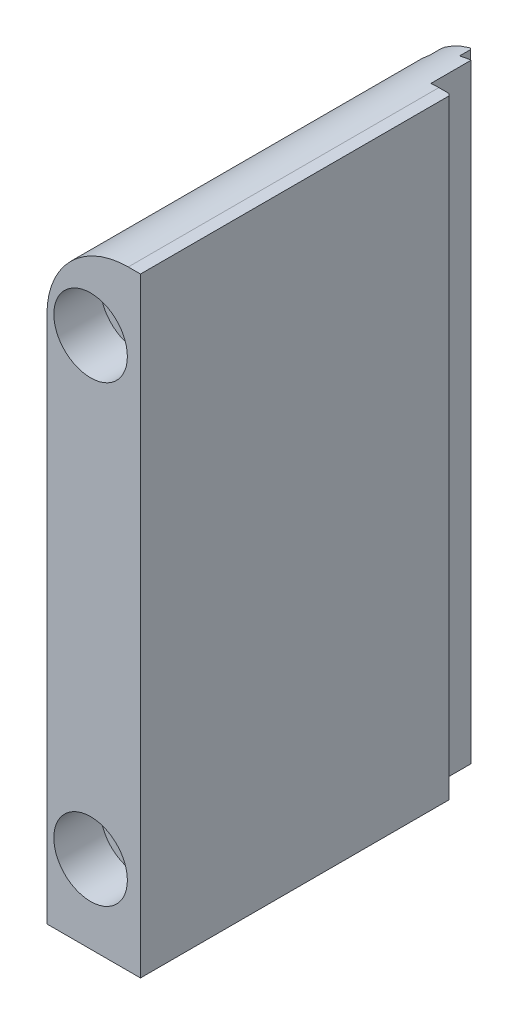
ISO-10303-21;
HEADER;
FILE_DESCRIPTION(('STEP AP214'),'2;1');
FILE_NAME('part.step','',(''),(''),'','','');
FILE_SCHEMA(('AUTOMOTIVE_DESIGN { 1 0 10303 214 1 1 1 1 }'));
ENDSEC;
DATA;
#1=APPLICATION_CONTEXT('core data for automotive mechanical design processes');
#2=APPLICATION_PROTOCOL_DEFINITION('international standard','automotive_design',2000,#1);
#3=PRODUCT_CONTEXT('',#1,'mechanical');
#4=PRODUCT('Part','Part','',(#3));
#5=PRODUCT_RELATED_PRODUCT_CATEGORY('part','',(#4));
#6=PRODUCT_DEFINITION_FORMATION('','',#4);
#7=PRODUCT_DEFINITION_CONTEXT('part definition',#1,'design');
#8=PRODUCT_DEFINITION('design','',#6,#7);
#9=PRODUCT_DEFINITION_SHAPE('','',#8);
#10=(LENGTH_UNIT() NAMED_UNIT(*) SI_UNIT(.MILLI.,.METRE.));
#11=(NAMED_UNIT(*) PLANE_ANGLE_UNIT() SI_UNIT($,.RADIAN.));
#12=(NAMED_UNIT(*) SI_UNIT($,.STERADIAN.) SOLID_ANGLE_UNIT());
#13=UNCERTAINTY_MEASURE_WITH_UNIT(LENGTH_MEASURE(1.E-05),#10,'distance_accuracy_value','');
#14=(GEOMETRIC_REPRESENTATION_CONTEXT(3) GLOBAL_UNCERTAINTY_ASSIGNED_CONTEXT((#13)) GLOBAL_UNIT_ASSIGNED_CONTEXT((#10,
#11,#12)) REPRESENTATION_CONTEXT('',''));
#15=CARTESIAN_POINT('',(0.,0.,0.));
#16=DIRECTION('',(0.,0.,1.));
#17=DIRECTION('',(1.,0.,0.));
#18=AXIS2_PLACEMENT_3D('',#15,#16,#17);
#19=CARTESIAN_POINT('',(-7.32028,29.845,-41.656));
#20=DIRECTION('',(0.,0.,-1.));
#21=DIRECTION('',(1.,0.,0.));
#22=AXIS2_PLACEMENT_3D('',#19,#20,#21);
#23=PLANE('',#22);
#24=CARTESIAN_POINT('',(-5.92328,-26.924,-41.656));
#25=DIRECTION('',(0.,0.,-1.));
#26=DIRECTION('',(-1.,0.,0.));
#27=AXIS2_PLACEMENT_3D('',#24,#25,#26);
#28=CIRCLE('',#27,2.7051);
#29=CARTESIAN_POINT('',(-8.62838,-26.924,-41.656));
#30=VERTEX_POINT('',#29);
#31=EDGE_CURVE('E322',#30,#30,#28,.T.);
#32=ORIENTED_EDGE('',*,*,#31,.F.);
#33=EDGE_LOOP('',(#32));
#34=FACE_BOUND('',#33,.T.);
#35=CARTESIAN_POINT('',(-5.92328,26.924,-41.656));
#36=DIRECTION('',(0.,0.,-1.));
#37=DIRECTION('',(-1.,0.,0.));
#38=AXIS2_PLACEMENT_3D('',#35,#36,#37);
#39=CIRCLE('',#38,2.7051);
#40=CARTESIAN_POINT('',(-8.62838,26.924,-41.656));
#41=VERTEX_POINT('',#40);
#42=EDGE_CURVE('E423',#41,#41,#39,.T.);
#43=ORIENTED_EDGE('',*,*,#42,.F.);
#44=EDGE_LOOP('',(#43));
#45=FACE_BOUND('',#44,.T.);
#46=CARTESIAN_POINT('',(-5.92328,26.924,-41.656));
#47=DIRECTION('',(0.,0.,1.));
#48=DIRECTION('',(1.,0.,0.));
#49=AXIS2_PLACEMENT_3D('',#46,#47,#48);
#50=CIRCLE('',#49,3.175);
#51=CARTESIAN_POINT('',(-2.74828,26.924,-41.656));
#52=VERTEX_POINT('',#51);
#53=CARTESIAN_POINT('',(-2.7482803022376,26.9226146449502,-41.656));
#54=VERTEX_POINT('',#53);
#55=EDGE_CURVE('E428',#52,#54,#50,.T.);
#56=ORIENTED_EDGE('',*,*,#55,.F.);
#57=DIRECTION('',(-1.,0.,0.));
#58=VECTOR('',#57,1.);
#59=CARTESIAN_POINT('',(-7.32028,26.924,-41.656));
#60=LINE('',#59,#58);
#61=CARTESIAN_POINT('',(-2.748026,26.924,-41.656));
#62=VERTEX_POINT('',#61);
#63=EDGE_CURVE('E476',#52,#62,#60,.F.);
#64=ORIENTED_EDGE('',*,*,#63,.T.);
#65=CARTESIAN_POINT('',(-5.92328,26.924,-41.656));
#66=DIRECTION('',(0.,0.,-1.));
#67=DIRECTION('',(-1.,0.,0.));
#68=AXIS2_PLACEMENT_3D('',#65,#66,#67);
#69=CIRCLE('',#68,3.175254);
#70=CARTESIAN_POINT('',(-3.76428,29.2522948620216,-41.656));
#71=VERTEX_POINT('',#70);
#72=EDGE_CURVE('E496',#71,#62,#69,.T.);
#73=ORIENTED_EDGE('',*,*,#72,.F.);
#74=DIRECTION('',(0.,-1.,0.));
#75=VECTOR('',#74,1.);
#76=CARTESIAN_POINT('',(-3.76428,29.845,-41.656));
#77=LINE('',#76,#75);
#78=CARTESIAN_POINT('',(-3.76428,35.9141543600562,-41.656));
#79=VERTEX_POINT('',#78);
#80=EDGE_CURVE('E372',#79,#71,#77,.T.);
#81=ORIENTED_EDGE('',*,*,#80,.F.);
#82=CARTESIAN_POINT('',(-1.45288,26.543,-41.656));
#83=DIRECTION('',(0.,0.,1.));
#84=DIRECTION('',(1.,0.,0.));
#85=AXIS2_PLACEMENT_3D('',#82,#83,#84);
#86=CIRCLE('',#85,9.652);
#87=CARTESIAN_POINT('',(-2.40538,36.1478866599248,-41.656));
#88=VERTEX_POINT('',#87);
#89=EDGE_CURVE('E346',#88,#79,#86,.T.);
#90=ORIENTED_EDGE('',*,*,#89,.F.);
#91=DIRECTION('',(0.,-1.,0.));
#92=VECTOR('',#91,1.);
#93=CARTESIAN_POINT('',(-2.40538,29.845,-41.656));
#94=LINE('',#93,#92);
#95=CARTESIAN_POINT('',(-2.40538,-36.195,-41.656));
#96=VERTEX_POINT('',#95);
#97=EDGE_CURVE('E375',#88,#96,#94,.T.);
#98=ORIENTED_EDGE('',*,*,#97,.T.);
#99=DIRECTION('',(-1.,0.,0.));
#100=VECTOR('',#99,1.);
#101=CARTESIAN_POINT('',(-11.07948,-36.195,-41.656));
#102=LINE('',#101,#100);
#103=CARTESIAN_POINT('',(-3.76428,-36.195,-41.656));
#104=VERTEX_POINT('',#103);
#105=EDGE_CURVE('E398',#96,#104,#102,.T.);
#106=ORIENTED_EDGE('',*,*,#105,.T.);
#107=CARTESIAN_POINT('',(-3.76428,-29.2522948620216,-41.656));
#108=VERTEX_POINT('',#107);
#109=EDGE_CURVE('E368',#108,#104,#77,.T.);
#110=ORIENTED_EDGE('',*,*,#109,.F.);
#111=CARTESIAN_POINT('',(-5.92328,-26.924,-41.656));
#112=DIRECTION('',(0.,0.,-1.));
#113=DIRECTION('',(-1.,0.,0.));
#114=AXIS2_PLACEMENT_3D('',#111,#112,#113);
#115=CIRCLE('',#114,3.175254);
#116=CARTESIAN_POINT('',(-2.74802630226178,-26.9253854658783,-41.656));
#117=VERTEX_POINT('',#116);
#118=EDGE_CURVE('E447',#117,#108,#115,.T.);
#119=ORIENTED_EDGE('',*,*,#118,.F.);
#120=DIRECTION('',(-0.999999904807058,0.000436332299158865,0.));
#121=VECTOR('',#120,1.);
#122=CARTESIAN_POINT('',(-7.34504987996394,-26.9233796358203,-41.656));
#123=LINE('',#122,#121);
#124=CARTESIAN_POINT('',(-2.7482803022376,-26.9253853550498,-41.656));
#125=VERTEX_POINT('',#124);
#126=EDGE_CURVE('E433',#117,#125,#123,.T.);
#127=ORIENTED_EDGE('',*,*,#126,.T.);
#128=CARTESIAN_POINT('',(-5.92328,-26.924,-41.656));
#129=DIRECTION('',(0.,0.,1.));
#130=DIRECTION('',(1.,0.,0.));
#131=AXIS2_PLACEMENT_3D('',#128,#129,#130);
#132=CIRCLE('',#131,3.175);
#133=CARTESIAN_POINT('',(-2.74828,-26.924,-41.656));
#134=VERTEX_POINT('',#133);
#135=EDGE_CURVE('E426',#134,#125,#132,.T.);
#136=ORIENTED_EDGE('',*,*,#135,.F.);
#137=DIRECTION('',(-1.,0.,0.));
#138=VECTOR('',#137,1.);
#139=CARTESIAN_POINT('',(-7.32028,-26.924,-41.656));
#140=LINE('',#139,#138);
#141=CARTESIAN_POINT('',(-2.748026,-26.924,-41.656));
#142=VERTEX_POINT('',#141);
#143=EDGE_CURVE('E430',#134,#142,#140,.F.);
#144=ORIENTED_EDGE('',*,*,#143,.T.);
#145=CARTESIAN_POINT('',(-3.76428,-24.5957051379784,-41.656));
#146=VERTEX_POINT('',#145);
#147=EDGE_CURVE('E436',#146,#142,#115,.T.);
#148=ORIENTED_EDGE('',*,*,#147,.F.);
#149=CARTESIAN_POINT('',(-3.76428,24.5957051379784,-41.656));
#150=VERTEX_POINT('',#149);
#151=EDGE_CURVE('E376',#150,#146,#77,.T.);
#152=ORIENTED_EDGE('',*,*,#151,.F.);
#153=CARTESIAN_POINT('',(-2.74802630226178,26.9226145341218,-41.656));
#154=VERTEX_POINT('',#153);
#155=EDGE_CURVE('E480',#154,#150,#69,.T.);
#156=ORIENTED_EDGE('',*,*,#155,.F.);
#157=DIRECTION('',(-0.999999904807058,0.000436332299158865,0.));
#158=VECTOR('',#157,1.);
#159=CARTESIAN_POINT('',(-7.32155426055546,26.9246101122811,-41.656));
#160=LINE('',#159,#158);
#161=EDGE_CURVE('E249',#154,#54,#160,.T.);
#162=ORIENTED_EDGE('',*,*,#161,.T.);
#163=EDGE_LOOP('',(#56,#64,#73,#81,#90,#98,#106,#110,#119,#127,#136,#144,#148,#152,#156,#162));
#164=FACE_BOUND('',#163,.T.);
#165=ADVANCED_FACE('F15',(#34,#45,#164),#23,.T.);
#166=CARTESIAN_POINT('',(-5.92328,26.924,-31.2166));
#167=DIRECTION('',(0.,0.,1.));
#168=DIRECTION('',(1.,0.,0.));
#169=AXIS2_PLACEMENT_3D('',#166,#167,#168);
#170=CONICAL_SURFACE('',#169,3.3147,0.785398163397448);
#171=CARTESIAN_POINT('',(-5.92328,26.924,-31.8262));
#172=DIRECTION('',(0.,0.,1.));
#173=DIRECTION('',(1.,0.,0.));
#174=AXIS2_PLACEMENT_3D('',#171,#172,#173);
#175=CIRCLE('',#174,2.7051);
#176=CARTESIAN_POINT('',(-3.21818,26.924,-31.8262));
#177=VERTEX_POINT('',#176);
#178=EDGE_CURVE('E273',#177,#177,#175,.T.);
#179=ORIENTED_EDGE('',*,*,#178,.F.);
#180=EDGE_LOOP('',(#179));
#181=FACE_BOUND('',#180,.T.);
#182=CARTESIAN_POINT('',(-5.92328,26.924,-31.2166));
#183=DIRECTION('',(0.,0.,-1.));
#184=DIRECTION('',(-1.,0.,0.));
#185=AXIS2_PLACEMENT_3D('',#182,#183,#184);
#186=CIRCLE('',#185,3.3147);
#187=CARTESIAN_POINT('',(-9.23798,26.924,-31.2166));
#188=VERTEX_POINT('',#187);
#189=EDGE_CURVE('E274',#188,#188,#186,.T.);
#190=ORIENTED_EDGE('',*,*,#189,.F.);
#191=EDGE_LOOP('',(#190));
#192=FACE_BOUND('',#191,.T.);
#193=CARTESIAN_POINT('',(-5.92328,26.924,-31.3563));
#194=DIRECTION('',(0.,0.,1.));
#195=DIRECTION('',(1.,0.,0.));
#196=AXIS2_PLACEMENT_3D('',#193,#194,#195);
#197=CIRCLE('',#196,3.175);
#198=CARTESIAN_POINT('',(-2.7482803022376,26.9226146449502,-31.3563));
#199=VERTEX_POINT('',#198);
#200=CARTESIAN_POINT('',(-2.74828,26.924,-31.3563));
#201=VERTEX_POINT('',#200);
#202=EDGE_CURVE('E9',#199,#201,#197,.F.);
#203=ORIENTED_EDGE('',*,*,#202,.F.);
#204=DIRECTION('',(0.707106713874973,-0.000308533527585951,0.707106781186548));
#205=VECTOR('',#204,1.);
#206=CARTESIAN_POINT('',(-5.92328,26.924,-34.5313));
#207=LINE('',#206,#205);
#208=CARTESIAN_POINT('',(-2.74802630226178,26.9226145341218,-31.356046));
#209=VERTEX_POINT('',#208);
#210=EDGE_CURVE('E241',#209,#199,#207,.F.);
#211=ORIENTED_EDGE('',*,*,#210,.F.);
#212=CARTESIAN_POINT('',(-5.92328,26.924,-31.356046));
#213=DIRECTION('',(0.,0.,1.));
#214=DIRECTION('',(1.,0.,0.));
#215=AXIS2_PLACEMENT_3D('',#212,#213,#214);
#216=CIRCLE('',#215,3.175254);
#217=CARTESIAN_POINT('',(-2.748026,26.924,-31.356046));
#218=VERTEX_POINT('',#217);
#219=EDGE_CURVE('E233',#209,#218,#216,.F.);
#220=ORIENTED_EDGE('',*,*,#219,.T.);
#221=DIRECTION('',(0.707106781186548,0.,0.707106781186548));
#222=VECTOR('',#221,1.);
#223=CARTESIAN_POINT('',(-5.92328,26.924,-34.5313));
#224=LINE('',#223,#222);
#225=EDGE_CURVE('E23',#201,#218,#224,.T.);
#226=ORIENTED_EDGE('',*,*,#225,.F.);
#227=EDGE_LOOP('',(#203,#211,#220,#226));
#228=FACE_BOUND('',#227,.T.);
#229=ADVANCED_FACE('F252',(#181,#192,#228),#170,.F.);
#230=CARTESIAN_POINT('',(-7.32028,24.0725742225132,-41.656));
#231=VERTEX_POINT('',#230);
#232=CARTESIAN_POINT('',(-7.32028,29.7754257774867,-41.656));
#233=VERTEX_POINT('',#232);
#234=EDGE_CURVE('E491',#231,#233,#69,.T.);
#235=ORIENTED_EDGE('',*,*,#234,.F.);
#236=DIRECTION('',(0.,-1.,0.));
#237=VECTOR('',#236,1.);
#238=CARTESIAN_POINT('',(-7.32028,29.845,-41.656));
#239=LINE('',#238,#237);
#240=CARTESIAN_POINT('',(-7.32028,-24.0725742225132,-41.656));
#241=VERTEX_POINT('',#240);
#242=EDGE_CURVE('E369',#231,#241,#239,.T.);
#243=ORIENTED_EDGE('',*,*,#242,.T.);
#244=CARTESIAN_POINT('',(-7.32028,-29.7754257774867,-41.656));
#245=VERTEX_POINT('',#244);
#246=EDGE_CURVE('E453',#245,#241,#115,.T.);
#247=ORIENTED_EDGE('',*,*,#246,.F.);
#248=CARTESIAN_POINT('',(-7.32028,-36.195,-41.656));
#249=VERTEX_POINT('',#248);
#250=EDGE_CURVE('E370',#245,#249,#239,.T.);
#251=ORIENTED_EDGE('',*,*,#250,.T.);
#252=DIRECTION('',(-1.,0.,0.));
#253=VECTOR('',#252,1.);
#254=CARTESIAN_POINT('',(-11.07948,-36.195,-41.656));
#255=LINE('',#254,#253);
#256=CARTESIAN_POINT('',(-11.10488,-36.195,-41.656));
#257=VERTEX_POINT('',#256);
#258=EDGE_CURVE('E297',#249,#257,#255,.T.);
#259=ORIENTED_EDGE('',*,*,#258,.T.);
#260=DIRECTION('',(0.,-1.,0.));
#261=VECTOR('',#260,1.);
#262=CARTESIAN_POINT('',(-11.10488,29.845,-41.656));
#263=LINE('',#262,#261);
#264=CARTESIAN_POINT('',(-11.10488,26.543,-41.656));
#265=VERTEX_POINT('',#264);
#266=EDGE_CURVE('E340',#265,#257,#263,.T.);
#267=ORIENTED_EDGE('',*,*,#266,.F.);
#268=CARTESIAN_POINT('',(-1.45288,26.543,-41.656));
#269=DIRECTION('',(0.,0.,1.));
#270=DIRECTION('',(1.,0.,0.));
#271=AXIS2_PLACEMENT_3D('',#268,#269,#270);
#272=CIRCLE('',#271,9.652);
#273=CARTESIAN_POINT('',(-7.32028,34.2068581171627,-41.656));
#274=VERTEX_POINT('',#273);
#275=EDGE_CURVE('E329',#274,#265,#272,.T.);
#276=ORIENTED_EDGE('',*,*,#275,.F.);
#277=EDGE_CURVE('E365',#274,#233,#239,.T.);
#278=ORIENTED_EDGE('',*,*,#277,.T.);
#279=EDGE_LOOP('',(#235,#243,#247,#251,#259,#267,#276,#278));
#280=FACE_BOUND('',#279,.T.);
#281=ADVANCED_FACE('F529',(#280),#23,.T.);
#282=CARTESIAN_POINT('',(-5.92328,-26.924,-31.2166));
#283=DIRECTION('',(0.,0.,1.));
#284=DIRECTION('',(1.,0.,0.));
#285=AXIS2_PLACEMENT_3D('',#282,#283,#284);
#286=CONICAL_SURFACE('',#285,3.3147,0.785398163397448);
#287=CARTESIAN_POINT('',(-5.92328,-26.924,-31.8262));
#288=DIRECTION('',(0.,0.,1.));
#289=DIRECTION('',(1.,0.,0.));
#290=AXIS2_PLACEMENT_3D('',#287,#288,#289);
#291=CIRCLE('',#290,2.7051);
#292=CARTESIAN_POINT('',(-3.21818,-26.924,-31.8262));
#293=VERTEX_POINT('',#292);
#294=EDGE_CURVE('E282',#293,#293,#291,.T.);
#295=ORIENTED_EDGE('',*,*,#294,.F.);
#296=EDGE_LOOP('',(#295));
#297=FACE_BOUND('',#296,.T.);
#298=CARTESIAN_POINT('',(-5.92328,-26.924,-31.2166));
#299=DIRECTION('',(0.,0.,-1.));
#300=DIRECTION('',(-1.,0.,0.));
#301=AXIS2_PLACEMENT_3D('',#298,#299,#300);
#302=CIRCLE('',#301,3.3147);
#303=CARTESIAN_POINT('',(-9.23798,-26.924,-31.2166));
#304=VERTEX_POINT('',#303);
#305=EDGE_CURVE('E283',#304,#304,#302,.T.);
#306=ORIENTED_EDGE('',*,*,#305,.F.);
#307=EDGE_LOOP('',(#306));
#308=FACE_BOUND('',#307,.T.);
#309=CARTESIAN_POINT('',(-5.92328,-26.924,-31.3563));
#310=DIRECTION('',(0.,0.,1.));
#311=DIRECTION('',(1.,0.,0.));
#312=AXIS2_PLACEMENT_3D('',#309,#310,#311);
#313=CIRCLE('',#312,3.175);
#314=CARTESIAN_POINT('',(-2.7482803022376,-26.9253853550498,-31.3563));
#315=VERTEX_POINT('',#314);
#316=CARTESIAN_POINT('',(-2.74828,-26.924,-31.3563));
#317=VERTEX_POINT('',#316);
#318=EDGE_CURVE('E242',#315,#317,#313,.F.);
#319=ORIENTED_EDGE('',*,*,#318,.F.);
#320=DIRECTION('',(0.707106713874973,-0.000308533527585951,0.707106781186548));
#321=VECTOR('',#320,1.);
#322=CARTESIAN_POINT('',(-5.92328,-26.924,-34.5313));
#323=LINE('',#322,#321);
#324=CARTESIAN_POINT('',(-2.74802630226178,-26.9253854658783,-31.356046));
#325=VERTEX_POINT('',#324);
#326=EDGE_CURVE('E259',#325,#315,#323,.F.);
#327=ORIENTED_EDGE('',*,*,#326,.F.);
#328=CARTESIAN_POINT('',(-5.92328,-26.924,-31.356046));
#329=DIRECTION('',(0.,0.,1.));
#330=DIRECTION('',(1.,0.,0.));
#331=AXIS2_PLACEMENT_3D('',#328,#329,#330);
#332=CIRCLE('',#331,3.175254);
#333=CARTESIAN_POINT('',(-2.748026,-26.924,-31.356046));
#334=VERTEX_POINT('',#333);
#335=EDGE_CURVE('E261',#325,#334,#332,.F.);
#336=ORIENTED_EDGE('',*,*,#335,.T.);
#337=DIRECTION('',(0.707106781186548,0.,0.707106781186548));
#338=VECTOR('',#337,1.);
#339=CARTESIAN_POINT('',(-5.92328,-26.924,-34.5313));
#340=LINE('',#339,#338);
#341=EDGE_CURVE('E256',#317,#334,#340,.T.);
#342=ORIENTED_EDGE('',*,*,#341,.F.);
#343=EDGE_LOOP('',(#319,#327,#336,#342));
#344=FACE_BOUND('',#343,.T.);
#345=ADVANCED_FACE('F540',(#297,#308,#344),#286,.F.);
#346=CARTESIAN_POINT('',(-3.76428,29.845,-41.656));
#347=DIRECTION('',(1.,0.,0.));
#348=DIRECTION('',(0.,0.,1.));
#349=AXIS2_PLACEMENT_3D('',#346,#347,#348);
#350=PLANE('',#349);
#351=DIRECTION('',(0.,0.,1.));
#352=VECTOR('',#351,1.);
#353=CARTESIAN_POINT('',(-3.76428,29.2522948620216,-31.2166));
#354=LINE('',#353,#352);
#355=CARTESIAN_POINT('',(-3.76428,29.2522948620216,-42.926));
#356=VERTEX_POINT('',#355);
#357=EDGE_CURVE('E498',#356,#71,#354,.T.);
#358=ORIENTED_EDGE('',*,*,#357,.F.);
#359=DIRECTION('',(0.,1.,0.));
#360=VECTOR('',#359,1.);
#361=CARTESIAN_POINT('',(-3.76428,29.845,-42.926));
#362=LINE('',#361,#360);
#363=CARTESIAN_POINT('',(-3.76428,35.9141543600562,-42.926));
#364=VERTEX_POINT('',#363);
#365=EDGE_CURVE('E325',#356,#364,#362,.T.);
#366=ORIENTED_EDGE('',*,*,#365,.T.);
#367=DIRECTION('',(0.,0.,1.));
#368=VECTOR('',#367,1.);
#369=CARTESIAN_POINT('',(-3.76428,35.9141543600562,-41.656));
#370=LINE('',#369,#368);
#371=EDGE_CURVE('E349',#79,#364,#370,.F.);
#372=ORIENTED_EDGE('',*,*,#371,.F.);
#373=ORIENTED_EDGE('',*,*,#80,.T.);
#374=EDGE_LOOP('',(#358,#366,#372,#373));
#375=FACE_BOUND('',#374,.T.);
#376=ADVANCED_FACE('F545',(#375),#350,.T.);
#377=CARTESIAN_POINT('',(-3.76428,29.845,-43.18));
#378=DIRECTION('',(0.,0.,-1.));
#379=DIRECTION('',(1.,0.,0.));
#380=AXIS2_PLACEMENT_3D('',#377,#378,#379);
#381=PLANE('',#380);
#382=CARTESIAN_POINT('',(-5.92328,26.924,-43.18));
#383=DIRECTION('',(0.,0.,-1.));
#384=DIRECTION('',(-1.,0.,0.));
#385=AXIS2_PLACEMENT_3D('',#382,#383,#384);
#386=CIRCLE('',#385,3.175254);
#387=CARTESIAN_POINT('',(-7.06628,29.886395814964,-43.18));
#388=VERTEX_POINT('',#387);
#389=CARTESIAN_POINT('',(-4.01828,29.4643174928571,-43.18));
#390=VERTEX_POINT('',#389);
#391=EDGE_CURVE('E30',#388,#390,#386,.T.);
#392=ORIENTED_EDGE('',*,*,#391,.F.);
#393=DIRECTION('',(0.,1.,0.));
#394=VECTOR('',#393,1.);
#395=CARTESIAN_POINT('',(-7.06628,29.845,-43.18));
#396=LINE('',#395,#394);
#397=CARTESIAN_POINT('',(-7.06628,34.3948051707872,-43.18));
#398=VERTEX_POINT('',#397);
#399=EDGE_CURVE('E359',#388,#398,#396,.T.);
#400=ORIENTED_EDGE('',*,*,#399,.T.);
#401=CARTESIAN_POINT('',(-1.45288,26.543,-43.18));
#402=DIRECTION('',(0.,0.,1.));
#403=DIRECTION('',(1.,0.,0.));
#404=AXIS2_PLACEMENT_3D('',#401,#402,#403);
#405=CIRCLE('',#404,9.652);
#406=CARTESIAN_POINT('',(-4.01828,35.8478281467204,-43.18));
#407=VERTEX_POINT('',#406);
#408=EDGE_CURVE('E330',#407,#398,#405,.T.);
#409=ORIENTED_EDGE('',*,*,#408,.F.);
#410=DIRECTION('',(0.,-1.,0.));
#411=VECTOR('',#410,1.);
#412=CARTESIAN_POINT('',(-4.01828,29.845,-43.18));
#413=LINE('',#412,#411);
#414=EDGE_CURVE('E382',#407,#390,#413,.T.);
#415=ORIENTED_EDGE('',*,*,#414,.T.);
#416=EDGE_LOOP('',(#392,#400,#409,#415));
#417=FACE_BOUND('',#416,.T.);
#418=ADVANCED_FACE('F586',(#417),#381,.T.);
#419=CARTESIAN_POINT('',(-7.32028,29.845,-42.926));
#420=DIRECTION('',(0.707106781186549,0.,0.707106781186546));
#421=DIRECTION('',(0.707106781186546,0.,-0.707106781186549));
#422=AXIS2_PLACEMENT_3D('',#419,#420,#421);
#423=PLANE('',#422);
#424=CARTESIAN_POINT('',(-5.92328,26.924,-44.323));
#425=DIRECTION('',(0.707106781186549,0.,0.707106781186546));
#426=DIRECTION('',(-0.707106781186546,0.,0.707106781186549));
#427=AXIS2_PLACEMENT_3D('',#424,#425,#426);
#428=ELLIPSE('',#427,4.49048727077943,3.175254);
#429=CARTESIAN_POINT('',(-7.32028,29.7754257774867,-42.926));
#430=VERTEX_POINT('',#429);
#431=EDGE_CURVE('E494',#430,#388,#428,.F.);
#432=ORIENTED_EDGE('',*,*,#431,.F.);
#433=DIRECTION('',(0.,-1.,0.));
#434=VECTOR('',#433,1.);
#435=CARTESIAN_POINT('',(-7.32028,29.845,-42.926));
#436=LINE('',#435,#434);
#437=CARTESIAN_POINT('',(-7.32028,34.2068581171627,-42.926));
#438=VERTEX_POINT('',#437);
#439=EDGE_CURVE('E360',#438,#430,#436,.T.);
#440=ORIENTED_EDGE('',*,*,#439,.F.);
#441=CARTESIAN_POINT('',(-1.45288,26.543,-48.7934));
#442=DIRECTION('',(0.707106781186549,0.,0.707106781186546));
#443=DIRECTION('',(-0.707106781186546,0.,0.707106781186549));
#444=AXIS2_PLACEMENT_3D('',#441,#442,#443);
#445=ELLIPSE('',#444,13.6499893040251,9.652);
#446=EDGE_CURVE('E323',#398,#438,#445,.T.);
#447=ORIENTED_EDGE('',*,*,#446,.F.);
#448=ORIENTED_EDGE('',*,*,#399,.F.);
#449=EDGE_LOOP('',(#432,#440,#447,#448));
#450=FACE_BOUND('',#449,.T.);
#451=ADVANCED_FACE('F583',(#450),#423,.F.);
#452=CARTESIAN_POINT('',(-7.32028,29.845,-43.18));
#453=DIRECTION('',(-1.,0.,0.));
#454=DIRECTION('',(0.,0.,-1.));
#455=AXIS2_PLACEMENT_3D('',#452,#453,#454);
#456=PLANE('',#455);
#457=DIRECTION('',(0.,0.,1.));
#458=VECTOR('',#457,1.);
#459=CARTESIAN_POINT('',(-7.32028,24.0725742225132,-31.2166));
#460=LINE('',#459,#458);
#461=CARTESIAN_POINT('',(-7.32028,24.0725742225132,-42.926));
#462=VERTEX_POINT('',#461);
#463=EDGE_CURVE('E489',#462,#231,#460,.T.);
#464=ORIENTED_EDGE('',*,*,#463,.F.);
#465=CARTESIAN_POINT('',(-7.32028,-24.0725742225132,-42.926));
#466=VERTEX_POINT('',#465);
#467=EDGE_CURVE('E364',#462,#466,#436,.T.);
#468=ORIENTED_EDGE('',*,*,#467,.T.);
#469=DIRECTION('',(0.,0.,1.));
#470=VECTOR('',#469,1.);
#471=CARTESIAN_POINT('',(-7.32028,-24.0725742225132,-31.2166));
#472=LINE('',#471,#470);
#473=EDGE_CURVE('E448',#241,#466,#472,.F.);
#474=ORIENTED_EDGE('',*,*,#473,.F.);
#475=ORIENTED_EDGE('',*,*,#242,.F.);
#476=EDGE_LOOP('',(#464,#468,#474,#475));
#477=FACE_BOUND('',#476,.T.);
#478=ADVANCED_FACE('F557',(#477),#456,.T.);
#479=CARTESIAN_POINT('',(-4.01828,29.845,-43.18));
#480=DIRECTION('',(-0.707106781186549,0.,0.707106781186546));
#481=DIRECTION('',(0.707106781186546,0.,0.707106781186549));
#482=AXIS2_PLACEMENT_3D('',#479,#480,#481);
#483=PLANE('',#482);
#484=CARTESIAN_POINT('',(-5.92328,26.924,-45.085));
#485=DIRECTION('',(-0.707106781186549,0.,0.707106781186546));
#486=DIRECTION('',(0.707106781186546,0.,0.707106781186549));
#487=AXIS2_PLACEMENT_3D('',#484,#485,#486);
#488=ELLIPSE('',#487,4.49048727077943,3.175254);
#489=CARTESIAN_POINT('',(-3.76428,24.5957051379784,-42.926));
#490=VERTEX_POINT('',#489);
#491=CARTESIAN_POINT('',(-4.01828,24.3836825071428,-43.18));
#492=VERTEX_POINT('',#491);
#493=EDGE_CURVE('E483',#490,#492,#488,.F.);
#494=ORIENTED_EDGE('',*,*,#493,.F.);
#495=CARTESIAN_POINT('',(-3.76428,-24.5957051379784,-42.926));
#496=VERTEX_POINT('',#495);
#497=EDGE_CURVE('E381',#496,#490,#362,.T.);
#498=ORIENTED_EDGE('',*,*,#497,.F.);
#499=CARTESIAN_POINT('',(-5.92328,-26.924,-45.085));
#500=DIRECTION('',(-0.707106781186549,0.,0.707106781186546));
#501=DIRECTION('',(0.707106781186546,0.,0.707106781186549));
#502=AXIS2_PLACEMENT_3D('',#499,#500,#501);
#503=ELLIPSE('',#502,4.49048727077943,3.175254);
#504=CARTESIAN_POINT('',(-4.01828,-24.3836825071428,-43.18));
#505=VERTEX_POINT('',#504);
#506=EDGE_CURVE('E440',#505,#496,#503,.F.);
#507=ORIENTED_EDGE('',*,*,#506,.F.);
#508=EDGE_CURVE('E385',#492,#505,#413,.T.);
#509=ORIENTED_EDGE('',*,*,#508,.F.);
#510=EDGE_LOOP('',(#494,#498,#507,#509));
#511=FACE_BOUND('',#510,.T.);
#512=ADVANCED_FACE('F649',(#511),#483,.F.);
#513=DIRECTION('',(0.,0.,1.));
#514=VECTOR('',#513,1.);
#515=CARTESIAN_POINT('',(-3.76428,24.5957051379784,-31.2166));
#516=LINE('',#515,#514);
#517=EDGE_CURVE('E481',#150,#490,#516,.F.);
#518=ORIENTED_EDGE('',*,*,#517,.F.);
#519=ORIENTED_EDGE('',*,*,#151,.T.);
#520=DIRECTION('',(0.,0.,1.));
#521=VECTOR('',#520,1.);
#522=CARTESIAN_POINT('',(-3.76428,-24.5957051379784,-31.2166));
#523=LINE('',#522,#521);
#524=EDGE_CURVE('E437',#496,#146,#523,.T.);
#525=ORIENTED_EDGE('',*,*,#524,.F.);
#526=ORIENTED_EDGE('',*,*,#497,.T.);
#527=EDGE_LOOP('',(#518,#519,#525,#526));
#528=FACE_BOUND('',#527,.T.);
#529=ADVANCED_FACE('F612',(#528),#350,.T.);
#530=CARTESIAN_POINT('',(-5.92328,26.924,-43.18));
#531=DIRECTION('',(0.,0.,-1.));
#532=DIRECTION('',(-1.,0.,0.));
#533=AXIS2_PLACEMENT_3D('',#530,#531,#532);
#534=CIRCLE('',#533,3.175254);
#535=CARTESIAN_POINT('',(-7.06628,23.961604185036,-43.18));
#536=VERTEX_POINT('',#535);
#537=EDGE_CURVE('E485',#492,#536,#534,.T.);
#538=ORIENTED_EDGE('',*,*,#537,.F.);
#539=ORIENTED_EDGE('',*,*,#508,.T.);
#540=CARTESIAN_POINT('',(-5.92328,-26.924,-43.18));
#541=DIRECTION('',(0.,0.,-1.));
#542=DIRECTION('',(-1.,0.,0.));
#543=AXIS2_PLACEMENT_3D('',#540,#541,#542);
#544=CIRCLE('',#543,3.175254);
#545=CARTESIAN_POINT('',(-7.06628,-23.961604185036,-43.18));
#546=VERTEX_POINT('',#545);
#547=EDGE_CURVE('E442',#546,#505,#544,.T.);
#548=ORIENTED_EDGE('',*,*,#547,.F.);
#549=EDGE_CURVE('E358',#546,#536,#396,.T.);
#550=ORIENTED_EDGE('',*,*,#549,.T.);
#551=EDGE_LOOP('',(#538,#539,#548,#550));
#552=FACE_BOUND('',#551,.T.);
#553=ADVANCED_FACE('F645',(#552),#381,.T.);
#554=DIRECTION('',(0.,0.,1.));
#555=VECTOR('',#554,1.);
#556=CARTESIAN_POINT('',(-7.32028,-29.7754257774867,-31.2166));
#557=LINE('',#556,#555);
#558=CARTESIAN_POINT('',(-7.32028,-29.7754257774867,-42.926));
#559=VERTEX_POINT('',#558);
#560=EDGE_CURVE('E456',#559,#245,#557,.T.);
#561=ORIENTED_EDGE('',*,*,#560,.F.);
#562=CARTESIAN_POINT('',(-7.32028,-36.195,-42.926));
#563=VERTEX_POINT('',#562);
#564=EDGE_CURVE('E333',#559,#563,#436,.T.);
#565=ORIENTED_EDGE('',*,*,#564,.T.);
#566=DIRECTION('',(0.,0.,1.));
#567=VECTOR('',#566,1.);
#568=CARTESIAN_POINT('',(-7.32028,-36.195,-36.8808));
#569=LINE('',#568,#567);
#570=EDGE_CURVE('E393',#563,#249,#569,.T.);
#571=ORIENTED_EDGE('',*,*,#570,.T.);
#572=ORIENTED_EDGE('',*,*,#250,.F.);
#573=EDGE_LOOP('',(#561,#565,#571,#572));
#574=FACE_BOUND('',#573,.T.);
#575=ADVANCED_FACE('F564',(#574),#456,.T.);
#576=CARTESIAN_POINT('',(-5.92328,26.924,-44.323));
#577=DIRECTION('',(0.707106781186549,0.,0.707106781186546));
#578=DIRECTION('',(-0.707106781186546,0.,0.707106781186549));
#579=AXIS2_PLACEMENT_3D('',#576,#577,#578);
#580=ELLIPSE('',#579,4.49048727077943,3.175254);
#581=EDGE_CURVE('E487',#536,#462,#580,.F.);
#582=ORIENTED_EDGE('',*,*,#581,.F.);
#583=ORIENTED_EDGE('',*,*,#549,.F.);
#584=CARTESIAN_POINT('',(-5.92328,-26.924,-44.323));
#585=DIRECTION('',(0.707106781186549,0.,0.707106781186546));
#586=DIRECTION('',(-0.707106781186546,0.,0.707106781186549));
#587=AXIS2_PLACEMENT_3D('',#584,#585,#586);
#588=ELLIPSE('',#587,4.49048727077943,3.175254);
#589=EDGE_CURVE('E445',#466,#546,#588,.F.);
#590=ORIENTED_EDGE('',*,*,#589,.F.);
#591=ORIENTED_EDGE('',*,*,#467,.F.);
#592=EDGE_LOOP('',(#582,#583,#590,#591));
#593=FACE_BOUND('',#592,.T.);
#594=ADVANCED_FACE('F641',(#593),#423,.F.);
#595=CARTESIAN_POINT('',(-5.92328,-26.924,-45.085));
#596=DIRECTION('',(-0.707106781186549,0.,0.707106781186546));
#597=DIRECTION('',(0.707106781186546,0.,0.707106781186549));
#598=AXIS2_PLACEMENT_3D('',#595,#596,#597);
#599=ELLIPSE('',#598,4.49048727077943,3.175254);
#600=CARTESIAN_POINT('',(-3.76428,-29.2522948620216,-42.926));
#601=VERTEX_POINT('',#600);
#602=CARTESIAN_POINT('',(-4.01828,-29.4643174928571,-43.18));
#603=VERTEX_POINT('',#602);
#604=EDGE_CURVE('E458',#601,#603,#599,.F.);
#605=ORIENTED_EDGE('',*,*,#604,.F.);
#606=CARTESIAN_POINT('',(-3.76428,-36.195,-42.926));
#607=VERTEX_POINT('',#606);
#608=EDGE_CURVE('E377',#607,#601,#362,.T.);
#609=ORIENTED_EDGE('',*,*,#608,.F.);
#610=DIRECTION('',(-0.707106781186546,0.,-0.707106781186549));
#611=VECTOR('',#610,1.);
#612=CARTESIAN_POINT('',(-4.01828,-36.195,-43.18));
#613=LINE('',#612,#611);
#614=CARTESIAN_POINT('',(-4.01828,-36.195,-43.18));
#615=VERTEX_POINT('',#614);
#616=EDGE_CURVE('E389',#615,#607,#613,.F.);
#617=ORIENTED_EDGE('',*,*,#616,.F.);
#618=EDGE_CURVE('E386',#603,#615,#413,.T.);
#619=ORIENTED_EDGE('',*,*,#618,.F.);
#620=EDGE_LOOP('',(#605,#609,#617,#619));
#621=FACE_BOUND('',#620,.T.);
#622=ADVANCED_FACE('F626',(#621),#483,.F.);
#623=CARTESIAN_POINT('',(-5.92328,26.924,-25.4));
#624=DIRECTION('',(0.,0.,-1.));
#625=DIRECTION('',(-1.,0.,0.));
#626=AXIS2_PLACEMENT_3D('',#623,#624,#625);
#627=CYLINDRICAL_SURFACE('',#626,2.7051);
#628=ORIENTED_EDGE('',*,*,#178,.T.);
#629=EDGE_LOOP('',(#628));
#630=FACE_BOUND('',#629,.T.);
#631=ORIENTED_EDGE('',*,*,#42,.T.);
#632=EDGE_LOOP('',(#631));
#633=FACE_BOUND('',#632,.T.);
#634=ADVANCED_FACE('F659',(#630,#633),#627,.F.);
#635=CARTESIAN_POINT('',(-5.92328,-26.924,-25.4));
#636=DIRECTION('',(0.,0.,-1.));
#637=DIRECTION('',(-1.,0.,0.));
#638=AXIS2_PLACEMENT_3D('',#635,#636,#637);
#639=CYLINDRICAL_SURFACE('',#638,2.7051);
#640=ORIENTED_EDGE('',*,*,#294,.T.);
#641=EDGE_LOOP('',(#640));
#642=FACE_BOUND('',#641,.T.);
#643=ORIENTED_EDGE('',*,*,#31,.T.);
#644=EDGE_LOOP('',(#643));
#645=FACE_BOUND('',#644,.T.);
#646=ADVANCED_FACE('F707',(#642,#645),#639,.F.);
#647=CARTESIAN_POINT('',(-11.10488,29.845,-41.656));
#648=DIRECTION('',(-1.,0.,0.));
#649=DIRECTION('',(0.,0.,-1.));
#650=AXIS2_PLACEMENT_3D('',#647,#648,#649);
#651=PLANE('',#650);
#652=ORIENTED_EDGE('',*,*,#266,.T.);
#653=DIRECTION('',(0.,0.,1.));
#654=VECTOR('',#653,1.);
#655=CARTESIAN_POINT('',(-11.10488,-36.195,-36.8808));
#656=LINE('',#655,#654);
#657=CARTESIAN_POINT('',(-11.10488,-36.195,0.));
#658=VERTEX_POINT('',#657);
#659=EDGE_CURVE('E268',#257,#658,#656,.T.);
#660=ORIENTED_EDGE('',*,*,#659,.T.);
#661=DIRECTION('',(0.,-1.,0.));
#662=VECTOR('',#661,1.);
#663=CARTESIAN_POINT('',(-11.10488,29.845,0.));
#664=LINE('',#663,#662);
#665=CARTESIAN_POINT('',(-11.10488,26.543,0.));
#666=VERTEX_POINT('',#665);
#667=EDGE_CURVE('E291',#666,#658,#664,.T.);
#668=ORIENTED_EDGE('',*,*,#667,.F.);
#669=DIRECTION('',(0.,0.,1.));
#670=VECTOR('',#669,1.);
#671=CARTESIAN_POINT('',(-11.10488,26.543,-41.656));
#672=LINE('',#671,#670);
#673=EDGE_CURVE('E302',#265,#666,#672,.T.);
#674=ORIENTED_EDGE('',*,*,#673,.F.);
#675=EDGE_LOOP('',(#652,#660,#668,#674));
#676=FACE_BOUND('',#675,.T.);
#677=ADVANCED_FACE('F572',(#676),#651,.T.);
#678=CARTESIAN_POINT('',(-11.07948,29.845,0.));
#679=DIRECTION('',(0.,0.,1.));
#680=DIRECTION('',(-1.,0.,0.));
#681=AXIS2_PLACEMENT_3D('',#678,#679,#680);
#682=PLANE('',#681);
#683=CARTESIAN_POINT('',(-5.92328,-26.924,0.));
#684=DIRECTION('',(0.,0.,1.));
#685=DIRECTION('',(1.,0.,0.));
#686=AXIS2_PLACEMENT_3D('',#683,#684,#685);
#687=CIRCLE('',#686,4.365625);
#688=CARTESIAN_POINT('',(-1.557655,-26.924,0.));
#689=VERTEX_POINT('',#688);
#690=EDGE_CURVE('E278',#689,#689,#687,.F.);
#691=ORIENTED_EDGE('',*,*,#690,.T.);
#692=EDGE_LOOP('',(#691));
#693=FACE_BOUND('',#692,.T.);
#694=CARTESIAN_POINT('',(-5.92328,26.924,0.));
#695=DIRECTION('',(0.,0.,1.));
#696=DIRECTION('',(1.,0.,0.));
#697=AXIS2_PLACEMENT_3D('',#694,#695,#696);
#698=CIRCLE('',#697,4.365625);
#699=CARTESIAN_POINT('',(-1.557655,26.924,0.));
#700=VERTEX_POINT('',#699);
#701=EDGE_CURVE('E269',#700,#700,#698,.F.);
#702=ORIENTED_EDGE('',*,*,#701,.T.);
#703=EDGE_LOOP('',(#702));
#704=FACE_BOUND('',#703,.T.);
#705=ORIENTED_EDGE('',*,*,#667,.T.);
#706=DIRECTION('',(1.,0.,0.));
#707=VECTOR('',#706,1.);
#708=CARTESIAN_POINT('',(-11.07948,-36.195,0.));
#709=LINE('',#708,#707);
#710=CARTESIAN_POINT('',(0.,-36.195,0.));
#711=VERTEX_POINT('',#710);
#712=EDGE_CURVE('E284',#658,#711,#709,.T.);
#713=ORIENTED_EDGE('',*,*,#712,.T.);
#714=DIRECTION('',(0.,-1.,0.));
#715=VECTOR('',#714,1.);
#716=CARTESIAN_POINT('',(0.,29.845,0.));
#717=LINE('',#716,#715);
#718=CARTESIAN_POINT('',(0.,36.195,0.));
#719=VERTEX_POINT('',#718);
#720=EDGE_CURVE('E288',#719,#711,#717,.T.);
#721=ORIENTED_EDGE('',*,*,#720,.F.);
#722=DIRECTION('',(1.,0.,0.));
#723=VECTOR('',#722,1.);
#724=CARTESIAN_POINT('',(-11.07948,36.195,0.));
#725=LINE('',#724,#723);
#726=CARTESIAN_POINT('',(-1.45288,36.195,0.));
#727=VERTEX_POINT('',#726);
#728=EDGE_CURVE('E293',#727,#719,#725,.T.);
#729=ORIENTED_EDGE('',*,*,#728,.F.);
#730=CARTESIAN_POINT('',(-1.45288,26.543,0.));
#731=DIRECTION('',(0.,0.,1.));
#732=DIRECTION('',(1.,0.,0.));
#733=AXIS2_PLACEMENT_3D('',#730,#731,#732);
#734=CIRCLE('',#733,9.652);
#735=EDGE_CURVE('E298',#666,#727,#734,.F.);
#736=ORIENTED_EDGE('',*,*,#735,.F.);
#737=EDGE_LOOP('',(#705,#713,#721,#729,#736));
#738=FACE_BOUND('',#737,.T.);
#739=ADVANCED_FACE('F706',(#693,#704,#738),#682,.T.);
#740=CARTESIAN_POINT('',(0.,29.845,-25.4));
#741=DIRECTION('',(1.,0.,0.));
#742=DIRECTION('',(0.,0.,1.));
#743=AXIS2_PLACEMENT_3D('',#740,#741,#742);
#744=PLANE('',#743);
#745=DIRECTION('',(0.,0.,-1.));
#746=VECTOR('',#745,1.);
#747=CARTESIAN_POINT('',(0.,-36.195,-36.8808));
#748=LINE('',#747,#746);
#749=CARTESIAN_POINT('',(0.,-36.195,-36.6268));
#750=VERTEX_POINT('',#749);
#751=EDGE_CURVE('E287',#711,#750,#748,.T.);
#752=ORIENTED_EDGE('',*,*,#751,.T.);
#753=DIRECTION('',(0.,1.,0.));
#754=VECTOR('',#753,1.);
#755=CARTESIAN_POINT('',(0.,29.845,-36.6268));
#756=LINE('',#755,#754);
#757=CARTESIAN_POINT('',(0.,36.195,-36.6268));
#758=VERTEX_POINT('',#757);
#759=EDGE_CURVE('E338',#750,#758,#756,.T.);
#760=ORIENTED_EDGE('',*,*,#759,.T.);
#761=DIRECTION('',(0.,0.,-1.));
#762=VECTOR('',#761,1.);
#763=CARTESIAN_POINT('',(0.,36.195,-36.8808));
#764=LINE('',#763,#762);
#765=EDGE_CURVE('E296',#719,#758,#764,.T.);
#766=ORIENTED_EDGE('',*,*,#765,.F.);
#767=ORIENTED_EDGE('',*,*,#720,.T.);
#768=EDGE_LOOP('',(#752,#760,#766,#767));
#769=FACE_BOUND('',#768,.T.);
#770=ADVANCED_FACE('F702',(#769),#744,.T.);
#771=CARTESIAN_POINT('',(0.00380999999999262,29.845,-36.8808));
#772=DIRECTION('',(0.,0.,-1.));
#773=DIRECTION('',(1.,0.,0.));
#774=AXIS2_PLACEMENT_3D('',#771,#772,#773);
#775=PLANE('',#774);
#776=DIRECTION('',(-1.,0.,0.));
#777=VECTOR('',#776,1.);
#778=CARTESIAN_POINT('',(0.00380999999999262,36.195,-36.8808));
#779=LINE('',#778,#777);
#780=CARTESIAN_POINT('',(-0.254000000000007,36.195,-36.8808));
#781=VERTEX_POINT('',#780);
#782=CARTESIAN_POINT('',(-1.45288,36.195,-36.8808));
#783=VERTEX_POINT('',#782);
#784=EDGE_CURVE('E336',#781,#783,#779,.T.);
#785=ORIENTED_EDGE('',*,*,#784,.F.);
#786=DIRECTION('',(0.,-1.,0.));
#787=VECTOR('',#786,1.);
#788=CARTESIAN_POINT('',(-0.254000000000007,29.845,-36.8808));
#789=LINE('',#788,#787);
#790=CARTESIAN_POINT('',(-0.254000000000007,-36.195,-36.8808));
#791=VERTEX_POINT('',#790);
#792=EDGE_CURVE('E380',#781,#791,#789,.T.);
#793=ORIENTED_EDGE('',*,*,#792,.T.);
#794=DIRECTION('',(-1.,0.,0.));
#795=VECTOR('',#794,1.);
#796=CARTESIAN_POINT('',(-11.07948,-36.195,-36.8808));
#797=LINE('',#796,#795);
#798=CARTESIAN_POINT('',(-2.40538,-36.195,-36.8808));
#799=VERTEX_POINT('',#798);
#800=EDGE_CURVE('E404',#791,#799,#797,.T.);
#801=ORIENTED_EDGE('',*,*,#800,.T.);
#802=DIRECTION('',(0.,-1.,0.));
#803=VECTOR('',#802,1.);
#804=CARTESIAN_POINT('',(-2.40538,29.845,-36.8808));
#805=LINE('',#804,#803);
#806=CARTESIAN_POINT('',(-2.40538,36.1478866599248,-36.8808));
#807=VERTEX_POINT('',#806);
#808=EDGE_CURVE('E292',#807,#799,#805,.T.);
#809=ORIENTED_EDGE('',*,*,#808,.F.);
#810=CARTESIAN_POINT('',(-1.45288,26.543,-36.8808));
#811=DIRECTION('',(0.,0.,1.));
#812=DIRECTION('',(1.,0.,0.));
#813=AXIS2_PLACEMENT_3D('',#810,#811,#812);
#814=CIRCLE('',#813,9.652);
#815=EDGE_CURVE('E311',#783,#807,#814,.T.);
#816=ORIENTED_EDGE('',*,*,#815,.F.);
#817=EDGE_LOOP('',(#785,#793,#801,#809,#816));
#818=FACE_BOUND('',#817,.T.);
#819=ADVANCED_FACE('F699',(#818),#775,.T.);
#820=CARTESIAN_POINT('',(-2.40538,29.845,-36.8808));
#821=DIRECTION('',(1.,0.,0.));
#822=DIRECTION('',(0.,0.,1.));
#823=AXIS2_PLACEMENT_3D('',#820,#821,#822);
#824=PLANE('',#823);
#825=DIRECTION('',(0.,0.,-1.));
#826=VECTOR('',#825,1.);
#827=CARTESIAN_POINT('',(-2.40538,-36.195,-36.8808));
#828=LINE('',#827,#826);
#829=EDGE_CURVE('E401',#799,#96,#828,.T.);
#830=ORIENTED_EDGE('',*,*,#829,.T.);
#831=ORIENTED_EDGE('',*,*,#97,.F.);
#832=DIRECTION('',(0.,0.,1.));
#833=VECTOR('',#832,1.);
#834=CARTESIAN_POINT('',(-2.40538,36.1478866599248,-36.8808));
#835=LINE('',#834,#833);
#836=EDGE_CURVE('E343',#807,#88,#835,.F.);
#837=ORIENTED_EDGE('',*,*,#836,.F.);
#838=ORIENTED_EDGE('',*,*,#808,.T.);
#839=EDGE_LOOP('',(#830,#831,#837,#838));
#840=FACE_BOUND('',#839,.T.);
#841=ADVANCED_FACE('F599',(#840),#824,.T.);
#842=DIRECTION('',(0.,0.,1.));
#843=VECTOR('',#842,1.);
#844=CARTESIAN_POINT('',(-3.76428,-29.2522948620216,-31.2166));
#845=LINE('',#844,#843);
#846=EDGE_CURVE('E451',#108,#601,#845,.F.);
#847=ORIENTED_EDGE('',*,*,#846,.F.);
#848=ORIENTED_EDGE('',*,*,#109,.T.);
#849=DIRECTION('',(0.,0.,-1.));
#850=VECTOR('',#849,1.);
#851=CARTESIAN_POINT('',(-3.76428,-36.195,-36.8808));
#852=LINE('',#851,#850);
#853=EDGE_CURVE('E394',#104,#607,#852,.T.);
#854=ORIENTED_EDGE('',*,*,#853,.T.);
#855=ORIENTED_EDGE('',*,*,#608,.T.);
#856=EDGE_LOOP('',(#847,#848,#854,#855));
#857=FACE_BOUND('',#856,.T.);
#858=ADVANCED_FACE('F622',(#857),#350,.T.);
#859=CARTESIAN_POINT('',(-5.92328,-26.924,-43.18));
#860=DIRECTION('',(0.,0.,-1.));
#861=DIRECTION('',(-1.,0.,0.));
#862=AXIS2_PLACEMENT_3D('',#859,#860,#861);
#863=CIRCLE('',#862,3.175254);
#864=CARTESIAN_POINT('',(-7.06628,-29.886395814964,-43.18));
#865=VERTEX_POINT('',#864);
#866=EDGE_CURVE('E460',#603,#865,#863,.T.);
#867=ORIENTED_EDGE('',*,*,#866,.F.);
#868=ORIENTED_EDGE('',*,*,#618,.T.);
#869=DIRECTION('',(-1.,0.,0.));
#870=VECTOR('',#869,1.);
#871=CARTESIAN_POINT('',(-11.07948,-36.195,-43.18));
#872=LINE('',#871,#870);
#873=CARTESIAN_POINT('',(-7.06628,-36.195,-43.18));
#874=VERTEX_POINT('',#873);
#875=EDGE_CURVE('E390',#615,#874,#872,.T.);
#876=ORIENTED_EDGE('',*,*,#875,.T.);
#877=EDGE_CURVE('E353',#874,#865,#396,.T.);
#878=ORIENTED_EDGE('',*,*,#877,.T.);
#879=EDGE_LOOP('',(#867,#868,#876,#878));
#880=FACE_BOUND('',#879,.T.);
#881=ADVANCED_FACE('F632',(#880),#381,.T.);
#882=DIRECTION('',(0.,0.,1.));
#883=VECTOR('',#882,1.);
#884=CARTESIAN_POINT('',(-7.32028,29.7754257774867,-31.2166));
#885=LINE('',#884,#883);
#886=EDGE_CURVE('E492',#233,#430,#885,.F.);
#887=ORIENTED_EDGE('',*,*,#886,.F.);
#888=ORIENTED_EDGE('',*,*,#277,.F.);
#889=DIRECTION('',(0.,0.,1.));
#890=VECTOR('',#889,1.);
#891=CARTESIAN_POINT('',(-7.32028,34.2068581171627,-43.18));
#892=LINE('',#891,#890);
#893=EDGE_CURVE('E327',#438,#274,#892,.T.);
#894=ORIENTED_EDGE('',*,*,#893,.F.);
#895=ORIENTED_EDGE('',*,*,#439,.T.);
#896=EDGE_LOOP('',(#887,#888,#894,#895));
#897=FACE_BOUND('',#896,.T.);
#898=ADVANCED_FACE('F580',(#897),#456,.T.);
#899=CARTESIAN_POINT('',(-11.07948,36.195,-36.8808));
#900=DIRECTION('',(0.,1.,0.));
#901=DIRECTION('',(0.,0.,1.));
#902=AXIS2_PLACEMENT_3D('',#899,#900,#901);
#903=PLANE('',#902);
#904=ORIENTED_EDGE('',*,*,#765,.T.);
#905=DIRECTION('',(0.707106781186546,0.,0.707106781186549));
#906=VECTOR('',#905,1.);
#907=CARTESIAN_POINT('',(-5.66674,36.195,-42.29354));
#908=LINE('',#907,#906);
#909=EDGE_CURVE('E264',#758,#781,#908,.F.);
#910=ORIENTED_EDGE('',*,*,#909,.T.);
#911=ORIENTED_EDGE('',*,*,#784,.T.);
#912=DIRECTION('',(0.,0.,1.));
#913=VECTOR('',#912,1.);
#914=CARTESIAN_POINT('',(-1.45288,36.195,-36.8808));
#915=LINE('',#914,#913);
#916=EDGE_CURVE('E301',#727,#783,#915,.F.);
#917=ORIENTED_EDGE('',*,*,#916,.F.);
#918=ORIENTED_EDGE('',*,*,#728,.T.);
#919=EDGE_LOOP('',(#904,#910,#911,#917,#918));
#920=FACE_BOUND('',#919,.T.);
#921=ADVANCED_FACE('F682',(#920),#903,.T.);
#922=CARTESIAN_POINT('',(-11.07948,-36.195,-36.8808));
#923=DIRECTION('',(0.,1.,0.));
#924=DIRECTION('',(0.,0.,1.));
#925=AXIS2_PLACEMENT_3D('',#922,#923,#924);
#926=PLANE('',#925);
#927=ORIENTED_EDGE('',*,*,#570,.F.);
#928=DIRECTION('',(-0.707106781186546,0.,0.707106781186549));
#929=VECTOR('',#928,1.);
#930=CARTESIAN_POINT('',(-7.32028,-36.195,-42.926));
#931=LINE('',#930,#929);
#932=EDGE_CURVE('E387',#563,#874,#931,.F.);
#933=ORIENTED_EDGE('',*,*,#932,.T.);
#934=ORIENTED_EDGE('',*,*,#875,.F.);
#935=ORIENTED_EDGE('',*,*,#616,.T.);
#936=ORIENTED_EDGE('',*,*,#853,.F.);
#937=ORIENTED_EDGE('',*,*,#105,.F.);
#938=ORIENTED_EDGE('',*,*,#829,.F.);
#939=ORIENTED_EDGE('',*,*,#800,.F.);
#940=DIRECTION('',(-0.707106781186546,0.,-0.707106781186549));
#941=VECTOR('',#940,1.);
#942=CARTESIAN_POINT('',(-0.254000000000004,-36.195,-36.8808));
#943=LINE('',#942,#941);
#944=EDGE_CURVE('E363',#791,#750,#943,.F.);
#945=ORIENTED_EDGE('',*,*,#944,.T.);
#946=ORIENTED_EDGE('',*,*,#751,.F.);
#947=ORIENTED_EDGE('',*,*,#712,.F.);
#948=ORIENTED_EDGE('',*,*,#659,.F.);
#949=ORIENTED_EDGE('',*,*,#258,.F.);
#950=EDGE_LOOP('',(#927,#933,#934,#935,#936,#937,#938,#939,#945,#946,#947,#948,#949));
#951=FACE_BOUND('',#950,.T.);
#952=ADVANCED_FACE('F569',(#951),#926,.F.);
#953=CARTESIAN_POINT('',(-1.45288,26.543,-41.656));
#954=DIRECTION('',(0.,0.,1.));
#955=DIRECTION('',(0.,-1.,0.));
#956=AXIS2_PLACEMENT_3D('',#953,#954,#955);
#957=CYLINDRICAL_SURFACE('',#956,9.652);
#958=ORIENTED_EDGE('',*,*,#408,.T.);
#959=ORIENTED_EDGE('',*,*,#446,.T.);
#960=ORIENTED_EDGE('',*,*,#893,.T.);
#961=ORIENTED_EDGE('',*,*,#275,.T.);
#962=ORIENTED_EDGE('',*,*,#673,.T.);
#963=ORIENTED_EDGE('',*,*,#735,.T.);
#964=ORIENTED_EDGE('',*,*,#916,.T.);
#965=ORIENTED_EDGE('',*,*,#815,.T.);
#966=ORIENTED_EDGE('',*,*,#836,.T.);
#967=ORIENTED_EDGE('',*,*,#89,.T.);
#968=ORIENTED_EDGE('',*,*,#371,.T.);
#969=CARTESIAN_POINT('',(-1.45288,26.543,-40.6146));
#970=DIRECTION('',(-0.707106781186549,0.,0.707106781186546));
#971=DIRECTION('',(0.707106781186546,0.,0.707106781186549));
#972=AXIS2_PLACEMENT_3D('',#969,#970,#971);
#973=ELLIPSE('',#972,13.6499893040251,9.652);
#974=EDGE_CURVE('E326',#364,#407,#973,.T.);
#975=ORIENTED_EDGE('',*,*,#974,.T.);
#976=EDGE_LOOP('',(#958,#959,#960,#961,#962,#963,#964,#965,#966,#967,#968,#975));
#977=FACE_BOUND('',#976,.T.);
#978=ADVANCED_FACE('F575',(#977),#957,.T.);
#979=CARTESIAN_POINT('',(-5.92328,-26.924,-44.323));
#980=DIRECTION('',(0.707106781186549,0.,0.707106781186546));
#981=DIRECTION('',(-0.707106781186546,0.,0.707106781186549));
#982=AXIS2_PLACEMENT_3D('',#979,#980,#981);
#983=ELLIPSE('',#982,4.49048727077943,3.175254);
#984=EDGE_CURVE('E462',#865,#559,#983,.F.);
#985=ORIENTED_EDGE('',*,*,#984,.F.);
#986=ORIENTED_EDGE('',*,*,#877,.F.);
#987=ORIENTED_EDGE('',*,*,#932,.F.);
#988=ORIENTED_EDGE('',*,*,#564,.F.);
#989=EDGE_LOOP('',(#985,#986,#987,#988));
#990=FACE_BOUND('',#989,.T.);
#991=ADVANCED_FACE('F635',(#990),#423,.F.);
#992=CARTESIAN_POINT('',(-5.92328,26.924,-45.085));
#993=DIRECTION('',(-0.707106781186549,0.,0.707106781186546));
#994=DIRECTION('',(0.707106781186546,0.,0.707106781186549));
#995=AXIS2_PLACEMENT_3D('',#992,#993,#994);
#996=ELLIPSE('',#995,4.49048727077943,3.175254);
#997=EDGE_CURVE('E501',#390,#356,#996,.F.);
#998=ORIENTED_EDGE('',*,*,#997,.F.);
#999=ORIENTED_EDGE('',*,*,#414,.F.);
#1000=ORIENTED_EDGE('',*,*,#974,.F.);
#1001=ORIENTED_EDGE('',*,*,#365,.F.);
#1002=EDGE_LOOP('',(#998,#999,#1000,#1001));
#1003=FACE_BOUND('',#1002,.T.);
#1004=ADVANCED_FACE('F591',(#1003),#483,.F.);
#1005=CARTESIAN_POINT('',(-0.254000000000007,29.845,-36.8808));
#1006=DIRECTION('',(-0.707106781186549,0.,0.707106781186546));
#1007=DIRECTION('',(0.707106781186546,0.,0.707106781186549));
#1008=AXIS2_PLACEMENT_3D('',#1005,#1006,#1007);
#1009=PLANE('',#1008);
#1010=ORIENTED_EDGE('',*,*,#909,.F.);
#1011=ORIENTED_EDGE('',*,*,#759,.F.);
#1012=ORIENTED_EDGE('',*,*,#944,.F.);
#1013=ORIENTED_EDGE('',*,*,#792,.F.);
#1014=EDGE_LOOP('',(#1010,#1011,#1012,#1013));
#1015=FACE_BOUND('',#1014,.T.);
#1016=ADVANCED_FACE('F661',(#1015),#1009,.F.);
#1017=CARTESIAN_POINT('',(-5.92328,26.924,-5.5372));
#1018=DIRECTION('',(0.,0.,-1.));
#1019=DIRECTION('',(-1.,0.,0.));
#1020=AXIS2_PLACEMENT_3D('',#1017,#1018,#1019);
#1021=PLANE('',#1020);
#1022=CARTESIAN_POINT('',(-5.92328,26.924,-5.5372));
#1023=DIRECTION('',(0.,0.,-1.));
#1024=DIRECTION('',(-1.,0.,0.));
#1025=AXIS2_PLACEMENT_3D('',#1022,#1023,#1024);
#1026=CIRCLE('',#1025,3.3147);
#1027=CARTESIAN_POINT('',(-9.23798,26.924,-5.5372));
#1028=VERTEX_POINT('',#1027);
#1029=EDGE_CURVE('E270',#1028,#1028,#1026,.T.);
#1030=ORIENTED_EDGE('',*,*,#1029,.T.);
#1031=EDGE_LOOP('',(#1030));
#1032=FACE_BOUND('',#1031,.T.);
#1033=CARTESIAN_POINT('',(-5.92328,26.924,-5.5372));
#1034=DIRECTION('',(0.,0.,-1.));
#1035=DIRECTION('',(-1.,0.,0.));
#1036=AXIS2_PLACEMENT_3D('',#1033,#1034,#1035);
#1037=CIRCLE('',#1036,4.365625);
#1038=CARTESIAN_POINT('',(-10.288905,26.924,-5.5372));
#1039=VERTEX_POINT('',#1038);
#1040=EDGE_CURVE('E265',#1039,#1039,#1037,.T.);
#1041=ORIENTED_EDGE('',*,*,#1040,.F.);
#1042=EDGE_LOOP('',(#1041));
#1043=FACE_BOUND('',#1042,.T.);
#1044=ADVANCED_FACE('F666',(#1032,#1043),#1021,.F.);
#1045=CARTESIAN_POINT('',(-5.92328,26.924,-25.4));
#1046=DIRECTION('',(0.,0.,-1.));
#1047=DIRECTION('',(-1.,0.,0.));
#1048=AXIS2_PLACEMENT_3D('',#1045,#1046,#1047);
#1049=CYLINDRICAL_SURFACE('',#1048,4.365625);
#1050=ORIENTED_EDGE('',*,*,#1040,.T.);
#1051=EDGE_LOOP('',(#1050));
#1052=FACE_BOUND('',#1051,.T.);
#1053=ORIENTED_EDGE('',*,*,#701,.F.);
#1054=EDGE_LOOP('',(#1053));
#1055=FACE_BOUND('',#1054,.T.);
#1056=ADVANCED_FACE('F715',(#1052,#1055),#1049,.F.);
#1057=CARTESIAN_POINT('',(-5.92328,-26.924,-5.5372));
#1058=DIRECTION('',(0.,0.,-1.));
#1059=DIRECTION('',(-1.,0.,0.));
#1060=AXIS2_PLACEMENT_3D('',#1057,#1058,#1059);
#1061=PLANE('',#1060);
#1062=CARTESIAN_POINT('',(-5.92328,-26.924,-5.5372));
#1063=DIRECTION('',(0.,0.,-1.));
#1064=DIRECTION('',(-1.,0.,0.));
#1065=AXIS2_PLACEMENT_3D('',#1062,#1063,#1064);
#1066=CIRCLE('',#1065,3.3147);
#1067=CARTESIAN_POINT('',(-9.23798,-26.924,-5.5372));
#1068=VERTEX_POINT('',#1067);
#1069=EDGE_CURVE('E279',#1068,#1068,#1066,.T.);
#1070=ORIENTED_EDGE('',*,*,#1069,.T.);
#1071=EDGE_LOOP('',(#1070));
#1072=FACE_BOUND('',#1071,.T.);
#1073=CARTESIAN_POINT('',(-5.92328,-26.924,-5.5372));
#1074=DIRECTION('',(0.,0.,-1.));
#1075=DIRECTION('',(-1.,0.,0.));
#1076=AXIS2_PLACEMENT_3D('',#1073,#1074,#1075);
#1077=CIRCLE('',#1076,4.365625);
#1078=CARTESIAN_POINT('',(-10.288905,-26.924,-5.5372));
#1079=VERTEX_POINT('',#1078);
#1080=EDGE_CURVE('E275',#1079,#1079,#1077,.T.);
#1081=ORIENTED_EDGE('',*,*,#1080,.F.);
#1082=EDGE_LOOP('',(#1081));
#1083=FACE_BOUND('',#1082,.T.);
#1084=ADVANCED_FACE('F17',(#1072,#1083),#1061,.F.);
#1085=CARTESIAN_POINT('',(-5.92328,-26.924,-25.4));
#1086=DIRECTION('',(0.,0.,-1.));
#1087=DIRECTION('',(-1.,0.,0.));
#1088=AXIS2_PLACEMENT_3D('',#1085,#1086,#1087);
#1089=CYLINDRICAL_SURFACE('',#1088,4.365625);
#1090=ORIENTED_EDGE('',*,*,#1080,.T.);
#1091=EDGE_LOOP('',(#1090));
#1092=FACE_BOUND('',#1091,.T.);
#1093=ORIENTED_EDGE('',*,*,#690,.F.);
#1094=EDGE_LOOP('',(#1093));
#1095=FACE_BOUND('',#1094,.T.);
#1096=ADVANCED_FACE('F730',(#1092,#1095),#1089,.F.);
#1097=CARTESIAN_POINT('',(-5.92328,-26.924,-12.7));
#1098=DIRECTION('',(0.,0.,-1.));
#1099=DIRECTION('',(-1.,0.,0.));
#1100=AXIS2_PLACEMENT_3D('',#1097,#1098,#1099);
#1101=CYLINDRICAL_SURFACE('',#1100,3.3147);
#1102=ORIENTED_EDGE('',*,*,#305,.T.);
#1103=EDGE_LOOP('',(#1102));
#1104=FACE_BOUND('',#1103,.T.);
#1105=ORIENTED_EDGE('',*,*,#1069,.F.);
#1106=EDGE_LOOP('',(#1105));
#1107=FACE_BOUND('',#1106,.T.);
#1108=ADVANCED_FACE('F723',(#1104,#1107),#1101,.F.);
#1109=CARTESIAN_POINT('',(-5.92328,26.924,-12.7));
#1110=DIRECTION('',(0.,0.,-1.));
#1111=DIRECTION('',(-1.,0.,0.));
#1112=AXIS2_PLACEMENT_3D('',#1109,#1110,#1111);
#1113=CYLINDRICAL_SURFACE('',#1112,3.3147);
#1114=ORIENTED_EDGE('',*,*,#189,.T.);
#1115=EDGE_LOOP('',(#1114));
#1116=FACE_BOUND('',#1115,.T.);
#1117=ORIENTED_EDGE('',*,*,#1029,.F.);
#1118=EDGE_LOOP('',(#1117));
#1119=FACE_BOUND('',#1118,.T.);
#1120=ADVANCED_FACE('F719',(#1116,#1119),#1113,.F.);
#1121=CARTESIAN_POINT('',(-2.74828,-26.924,-37.5666));
#1122=DIRECTION('',(0.,-1.,0.));
#1123=DIRECTION('',(0.,0.,-1.));
#1124=AXIS2_PLACEMENT_3D('',#1121,#1122,#1123);
#1125=PLANE('',#1124);
#1126=DIRECTION('',(0.,0.,-1.));
#1127=VECTOR('',#1126,1.);
#1128=CARTESIAN_POINT('',(-2.74828,-26.924,-31.2166));
#1129=LINE('',#1128,#1127);
#1130=EDGE_CURVE('E464',#317,#134,#1129,.T.);
#1131=ORIENTED_EDGE('',*,*,#1130,.F.);
#1132=ORIENTED_EDGE('',*,*,#341,.T.);
#1133=DIRECTION('',(0.,0.,1.));
#1134=VECTOR('',#1133,1.);
#1135=CARTESIAN_POINT('',(-2.748026,-26.924,-31.2166));
#1136=LINE('',#1135,#1134);
#1137=EDGE_CURVE('E470',#334,#142,#1136,.F.);
#1138=ORIENTED_EDGE('',*,*,#1137,.T.);
#1139=ORIENTED_EDGE('',*,*,#143,.F.);
#1140=EDGE_LOOP('',(#1131,#1132,#1138,#1139));
#1141=FACE_BOUND('',#1140,.T.);
#1142=ADVANCED_FACE('F722',(#1141),#1125,.F.);
#1143=CARTESIAN_POINT('',(-2.7482803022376,-26.9253853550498,-37.5666));
#1144=DIRECTION('',(-0.000436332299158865,-0.999999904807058,0.));
#1145=DIRECTION('',(0.,0.,-1.));
#1146=AXIS2_PLACEMENT_3D('',#1143,#1144,#1145);
#1147=PLANE('',#1146);
#1148=DIRECTION('',(0.,0.,1.));
#1149=VECTOR('',#1148,1.);
#1150=CARTESIAN_POINT('',(-2.74802630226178,-26.9253854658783,-31.2166));
#1151=LINE('',#1150,#1149);
#1152=EDGE_CURVE('E473',#325,#117,#1151,.F.);
#1153=ORIENTED_EDGE('',*,*,#1152,.F.);
#1154=ORIENTED_EDGE('',*,*,#326,.T.);
#1155=DIRECTION('',(0.,0.,-1.));
#1156=VECTOR('',#1155,1.);
#1157=CARTESIAN_POINT('',(-2.7482803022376,-26.9253853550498,-31.2166));
#1158=LINE('',#1157,#1156);
#1159=EDGE_CURVE('E467',#315,#125,#1158,.T.);
#1160=ORIENTED_EDGE('',*,*,#1159,.T.);
#1161=ORIENTED_EDGE('',*,*,#126,.F.);
#1162=EDGE_LOOP('',(#1153,#1154,#1160,#1161));
#1163=FACE_BOUND('',#1162,.T.);
#1164=ADVANCED_FACE('F790',(#1163),#1147,.T.);
#1165=CARTESIAN_POINT('',(-5.92328,-26.924,-31.2166));
#1166=DIRECTION('',(0.,0.,1.));
#1167=DIRECTION('',(1.,0.,0.));
#1168=AXIS2_PLACEMENT_3D('',#1165,#1166,#1167);
#1169=CYLINDRICAL_SURFACE('',#1168,3.175);
#1170=ORIENTED_EDGE('',*,*,#1159,.F.);
#1171=ORIENTED_EDGE('',*,*,#318,.T.);
#1172=ORIENTED_EDGE('',*,*,#1130,.T.);
#1173=ORIENTED_EDGE('',*,*,#135,.T.);
#1174=EDGE_LOOP('',(#1170,#1171,#1172,#1173));
#1175=FACE_BOUND('',#1174,.T.);
#1176=ADVANCED_FACE('F798',(#1175),#1169,.T.);
#1177=CARTESIAN_POINT('',(-5.92328,-26.924,-31.2166));
#1178=DIRECTION('',(0.,0.,1.));
#1179=DIRECTION('',(1.,0.,0.));
#1180=AXIS2_PLACEMENT_3D('',#1177,#1178,#1179);
#1181=CYLINDRICAL_SURFACE('',#1180,3.175254);
#1182=ORIENTED_EDGE('',*,*,#147,.T.);
#1183=ORIENTED_EDGE('',*,*,#1137,.F.);
#1184=ORIENTED_EDGE('',*,*,#335,.F.);
#1185=ORIENTED_EDGE('',*,*,#1152,.T.);
#1186=ORIENTED_EDGE('',*,*,#118,.T.);
#1187=ORIENTED_EDGE('',*,*,#846,.T.);
#1188=ORIENTED_EDGE('',*,*,#604,.T.);
#1189=ORIENTED_EDGE('',*,*,#866,.T.);
#1190=ORIENTED_EDGE('',*,*,#984,.T.);
#1191=ORIENTED_EDGE('',*,*,#560,.T.);
#1192=ORIENTED_EDGE('',*,*,#246,.T.);
#1193=ORIENTED_EDGE('',*,*,#473,.T.);
#1194=ORIENTED_EDGE('',*,*,#589,.T.);
#1195=ORIENTED_EDGE('',*,*,#547,.T.);
#1196=ORIENTED_EDGE('',*,*,#506,.T.);
#1197=ORIENTED_EDGE('',*,*,#524,.T.);
#1198=EDGE_LOOP('',(#1182,#1183,#1184,#1185,#1186,#1187,#1188,#1189,#1190,#1191,#1192,#1193,
#1194,#1195,#1196,#1197));
#1199=FACE_BOUND('',#1198,.T.);
#1200=ADVANCED_FACE('F617',(#1199),#1181,.F.);
#1201=CARTESIAN_POINT('',(-2.74828,26.924,-37.5666));
#1202=DIRECTION('',(0.,-1.,0.));
#1203=DIRECTION('',(0.,0.,-1.));
#1204=AXIS2_PLACEMENT_3D('',#1201,#1202,#1203);
#1205=PLANE('',#1204);
#1206=DIRECTION('',(0.,0.,-1.));
#1207=VECTOR('',#1206,1.);
#1208=CARTESIAN_POINT('',(-2.74828,26.924,-31.2166));
#1209=LINE('',#1208,#1207);
#1210=EDGE_CURVE('E503',#201,#52,#1209,.T.);
#1211=ORIENTED_EDGE('',*,*,#1210,.F.);
#1212=ORIENTED_EDGE('',*,*,#225,.T.);
#1213=DIRECTION('',(0.,0.,1.));
#1214=VECTOR('',#1213,1.);
#1215=CARTESIAN_POINT('',(-2.748026,26.924,-31.2166));
#1216=LINE('',#1215,#1214);
#1217=EDGE_CURVE('E37',#218,#62,#1216,.F.);
#1218=ORIENTED_EDGE('',*,*,#1217,.T.);
#1219=ORIENTED_EDGE('',*,*,#63,.F.);
#1220=EDGE_LOOP('',(#1211,#1212,#1218,#1219));
#1221=FACE_BOUND('',#1220,.T.);
#1222=ADVANCED_FACE('F511',(#1221),#1205,.F.);
#1223=CARTESIAN_POINT('',(-2.7482803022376,26.9226146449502,-37.5666));
#1224=DIRECTION('',(-0.000436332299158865,-0.999999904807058,0.));
#1225=DIRECTION('',(0.,0.,-1.));
#1226=AXIS2_PLACEMENT_3D('',#1223,#1224,#1225);
#1227=PLANE('',#1226);
#1228=DIRECTION('',(0.,0.,1.));
#1229=VECTOR('',#1228,1.);
#1230=CARTESIAN_POINT('',(-2.74802630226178,26.9226145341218,-31.2166));
#1231=LINE('',#1230,#1229);
#1232=EDGE_CURVE('E236',#209,#154,#1231,.F.);
#1233=ORIENTED_EDGE('',*,*,#1232,.F.);
#1234=ORIENTED_EDGE('',*,*,#210,.T.);
#1235=DIRECTION('',(0.,0.,-1.));
#1236=VECTOR('',#1235,1.);
#1237=CARTESIAN_POINT('',(-2.7482803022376,26.9226146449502,-31.2166));
#1238=LINE('',#1237,#1236);
#1239=EDGE_CURVE('E506',#199,#54,#1238,.T.);
#1240=ORIENTED_EDGE('',*,*,#1239,.T.);
#1241=ORIENTED_EDGE('',*,*,#161,.F.);
#1242=EDGE_LOOP('',(#1233,#1234,#1240,#1241));
#1243=FACE_BOUND('',#1242,.T.);
#1244=ADVANCED_FACE('F245',(#1243),#1227,.T.);
#1245=CARTESIAN_POINT('',(-5.92328,26.924,-31.2166));
#1246=DIRECTION('',(0.,0.,1.));
#1247=DIRECTION('',(1.,0.,0.));
#1248=AXIS2_PLACEMENT_3D('',#1245,#1246,#1247);
#1249=CYLINDRICAL_SURFACE('',#1248,3.175);
#1250=ORIENTED_EDGE('',*,*,#1210,.T.);
#1251=ORIENTED_EDGE('',*,*,#55,.T.);
#1252=ORIENTED_EDGE('',*,*,#1239,.F.);
#1253=ORIENTED_EDGE('',*,*,#202,.T.);
#1254=EDGE_LOOP('',(#1250,#1251,#1252,#1253));
#1255=FACE_BOUND('',#1254,.T.);
#1256=ADVANCED_FACE('F516',(#1255),#1249,.T.);
#1257=CARTESIAN_POINT('',(-5.92328,26.924,-31.2166));
#1258=DIRECTION('',(0.,0.,1.));
#1259=DIRECTION('',(1.,0.,0.));
#1260=AXIS2_PLACEMENT_3D('',#1257,#1258,#1259);
#1261=CYLINDRICAL_SURFACE('',#1260,3.175254);
#1262=ORIENTED_EDGE('',*,*,#155,.T.);
#1263=ORIENTED_EDGE('',*,*,#517,.T.);
#1264=ORIENTED_EDGE('',*,*,#493,.T.);
#1265=ORIENTED_EDGE('',*,*,#537,.T.);
#1266=ORIENTED_EDGE('',*,*,#581,.T.);
#1267=ORIENTED_EDGE('',*,*,#463,.T.);
#1268=ORIENTED_EDGE('',*,*,#234,.T.);
#1269=ORIENTED_EDGE('',*,*,#886,.T.);
#1270=ORIENTED_EDGE('',*,*,#431,.T.);
#1271=ORIENTED_EDGE('',*,*,#391,.T.);
#1272=ORIENTED_EDGE('',*,*,#997,.T.);
#1273=ORIENTED_EDGE('',*,*,#357,.T.);
#1274=ORIENTED_EDGE('',*,*,#72,.T.);
#1275=ORIENTED_EDGE('',*,*,#1217,.F.);
#1276=ORIENTED_EDGE('',*,*,#219,.F.);
#1277=ORIENTED_EDGE('',*,*,#1232,.T.);
#1278=EDGE_LOOP('',(#1262,#1263,#1264,#1265,#1266,#1267,#1268,#1269,#1270,#1271,#1272,#1273,
#1274,#1275,#1276,#1277));
#1279=FACE_BOUND('',#1278,.T.);
#1280=ADVANCED_FACE('F235',(#1279),#1261,.F.);
#1281=CLOSED_SHELL('',(#165,#229,#281,#345,#376,#418,#451,#478,#512,#529,#553,#575,#594,#622,
#634,#646,#677,#739,#770,#819,#841,#858,#881,#898,#921,#952,#978,#991,#1004,#1016,#1044,#1056,
#1084,#1096,#1108,#1120,#1142,#1164,#1176,#1200,#1222,#1244,#1256,#1280));
#1282=MANIFOLD_SOLID_BREP('B1',#1281);
#1283=ADVANCED_BREP_SHAPE_REPRESENTATION('',(#18,#1282),#14);
#1284=SHAPE_DEFINITION_REPRESENTATION(#9,#1283);
ENDSEC;
END-ISO-10303-21;
